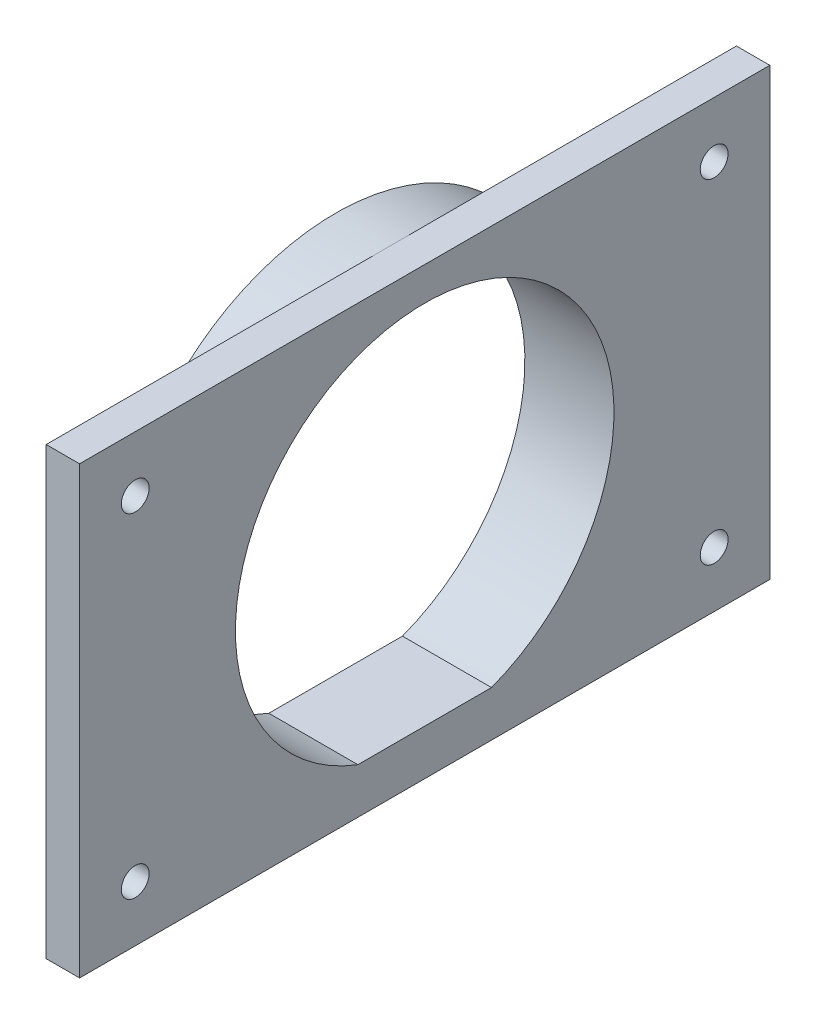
from build123d import *

# Parameters (mm, degrees)
ESQUISSE6_W             = 62
ESQUISSE6_H             = 40
BOSS_EXTRU_3_DEPTH      = 3
ESQUISSE11_R            = 20
BOSS_EXTRU_4_DEPTH      = 8
ENL_V_MAT_EXTRU_2_DEPTH = 38.749172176
ESQUISSE14_R            = 1.25
ENL_V_MAT_EXTRU_4_DEPTH = 38.229020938
CHANFREIN1_SIZE         = 1


with BuildPart() as part:
    # Esquisse6 → Boss.-Extru.3 (new body)
    with BuildSketch(Plane(origin=(0, 0, 0), x_dir=(0, 0, -1), z_dir=(1, 0, 0))):
        Rectangle(ESQUISSE6_W, ESQUISSE6_H)
    extrude(amount=-BOSS_EXTRU_3_DEPTH)

    # Esquisse11 → Boss.-Extru.4 (add)
    with BuildSketch(Plane.ZY):
        with Locations(Location((0, 0, 0), (0, 0, 270))):
            Circle(ESQUISSE11_R)
    extrude(amount=BOSS_EXTRU_4_DEPTH)

    # Esquisse12 → Enl_v. mat.-Extru.2 (cut, through all)
    with BuildSketch(Plane.ZY.offset(8)):
        with BuildLine():
            Line((6, -15.905973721), (-6, -15.905973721))
            ThreePointArc((-6, -15.905973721), (0, 17), (6, -15.905973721))
        make_face()
    extrude(amount=-ENL_V_MAT_EXTRU_2_DEPTH, mode=Mode.SUBTRACT)

    # Esquisse14 → Enl_v. mat.-Extru.4 (cut, through all)
    with BuildSketch(Plane.ZY.offset(3)):
        with Locations((-26, 15)):
            Circle(ESQUISSE14_R)
        with Locations((26, 15)):
            Circle(ESQUISSE14_R)
        with Locations((26, -15)):
            Circle(ESQUISSE14_R)
        with Locations((-26, -15)):
            Circle(ESQUISSE14_R)
    extrude(amount=-ENL_V_MAT_EXTRU_4_DEPTH, mode=Mode.SUBTRACT)

    # Chanfrein1
    chanfrein1_edges = [part.edges().sort_by_distance(p)[0] for p in [
        (-3, 15, -27.25),
        (-3, 15, 24.75),
        (-3, -15, 24.75),
        (-3, -15, -27.25),
    ]]
    chamfer(chanfrein1_edges, length=CHANFREIN1_SIZE)


solid = part.part
